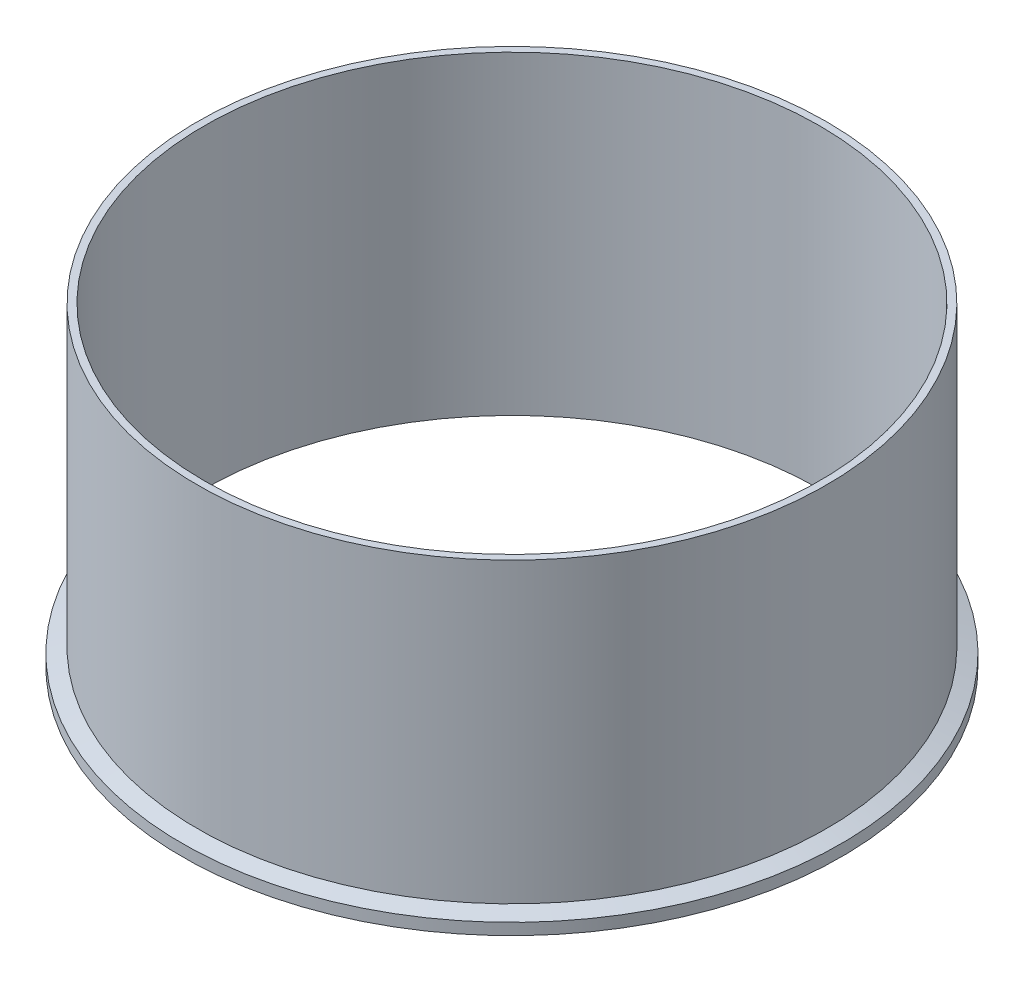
from build123d import *


with BuildPart() as part:
    # Sketch1 → Revolve2 (revolve)
    with BuildSketch(Plane.XY, mode=Mode.PRIVATE) as revolve2_sk:
        with BuildLine():
            Line((-148.9964, 0), (-148.9964, 152.4))
            Line((-148.9964, 152.4), (-152.4, 152.4))
            Line((-152.4, 152.4), (-152.4, 8.222780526))
            Line((-152.4, 8.222780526), (-159.639, 5.588))
            Line((-159.639, 5.588), (-159.639, 0))
            Line((-159.639, 0), (-156.199208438, 0))
            ThreePointArc((-156.199208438, 0), (-155.767011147, 0.129217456), (-155.476666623, 0.474458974))
            ThreePointArc((-155.476666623, 0.474458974), (-154.3812, 1.1938), (-153.285733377, 0.474458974))
            ThreePointArc((-153.285733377, 0.474458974), (-152.995388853, 0.129217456), (-152.563191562, 0))
            Line((-152.563191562, 0), (-148.9964, 0))
        make_face()
    revolve(revolve2_sk.sketch.rotate(Axis((0, 0, 0), (0, 1, 0)), 270), axis=Axis((0, 0, 0), (0, 1, 0)))


solid = part.part
